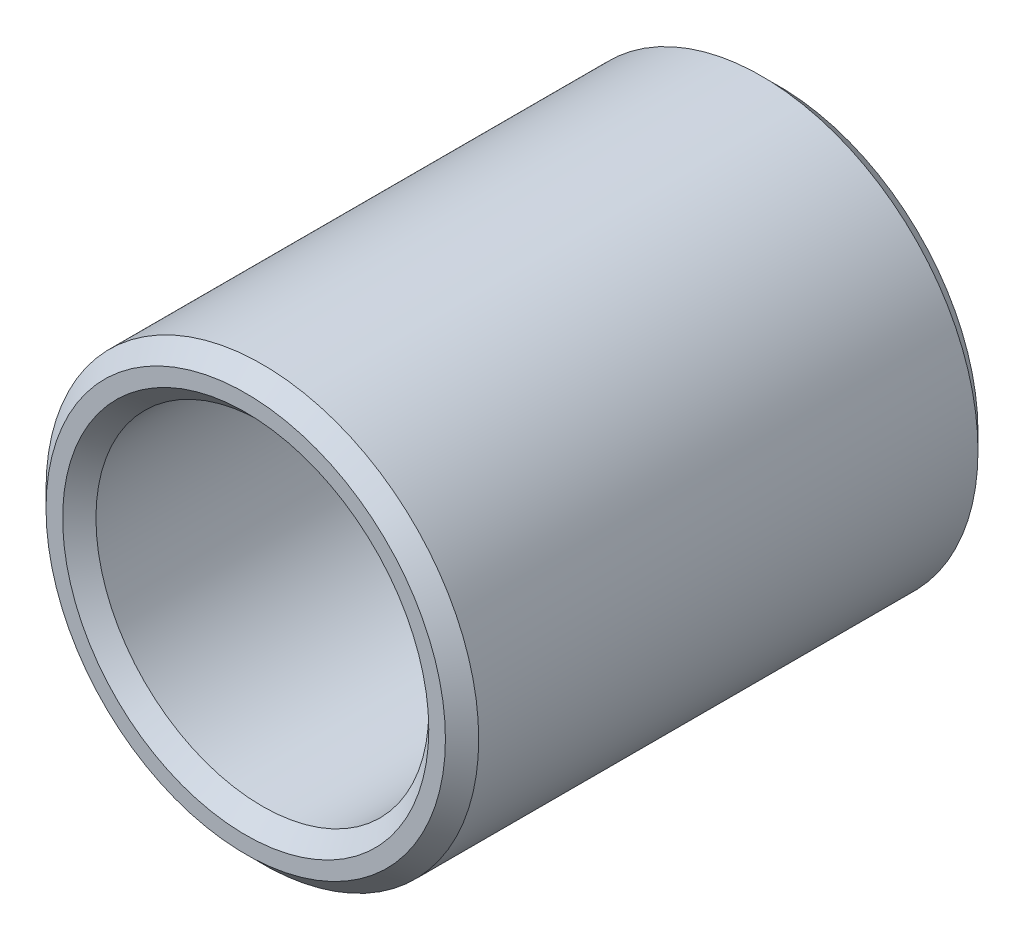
ISO-10303-21;
HEADER;
FILE_DESCRIPTION(('STEP AP214'),'2;1');
FILE_NAME('part.step','',(''),(''),'','','');
FILE_SCHEMA(('AUTOMOTIVE_DESIGN { 1 0 10303 214 1 1 1 1 }'));
ENDSEC;
DATA;
#1=APPLICATION_CONTEXT('core data for automotive mechanical design processes');
#2=APPLICATION_PROTOCOL_DEFINITION('international standard','automotive_design',2000,#1);
#3=PRODUCT_CONTEXT('',#1,'mechanical');
#4=PRODUCT('Part','Part','',(#3));
#5=PRODUCT_RELATED_PRODUCT_CATEGORY('part','',(#4));
#6=PRODUCT_DEFINITION_FORMATION('','',#4);
#7=PRODUCT_DEFINITION_CONTEXT('part definition',#1,'design');
#8=PRODUCT_DEFINITION('design','',#6,#7);
#9=PRODUCT_DEFINITION_SHAPE('','',#8);
#10=(LENGTH_UNIT() NAMED_UNIT(*) SI_UNIT(.MILLI.,.METRE.));
#11=(NAMED_UNIT(*) PLANE_ANGLE_UNIT() SI_UNIT($,.RADIAN.));
#12=(NAMED_UNIT(*) SI_UNIT($,.STERADIAN.) SOLID_ANGLE_UNIT());
#13=UNCERTAINTY_MEASURE_WITH_UNIT(LENGTH_MEASURE(1.E-05),#10,'distance_accuracy_value','');
#14=(GEOMETRIC_REPRESENTATION_CONTEXT(3) GLOBAL_UNCERTAINTY_ASSIGNED_CONTEXT((#13)) GLOBAL_UNIT_ASSIGNED_CONTEXT((#10,
#11,#12)) REPRESENTATION_CONTEXT('',''));
#15=CARTESIAN_POINT('',(0.,0.,0.));
#16=DIRECTION('',(0.,0.,1.));
#17=DIRECTION('',(1.,0.,0.));
#18=AXIS2_PLACEMENT_3D('',#15,#16,#17);
#19=CARTESIAN_POINT('',(0.,0.,32.));
#20=DIRECTION('',(0.,0.,1.));
#21=DIRECTION('',(1.,0.,0.));
#22=AXIS2_PLACEMENT_3D('',#19,#20,#21);
#23=PLANE('',#22);
#24=CARTESIAN_POINT('',(0.,0.,32.));
#25=DIRECTION('',(0.,0.,1.));
#26=DIRECTION('',(1.,0.,0.));
#27=AXIS2_PLACEMENT_3D('',#24,#25,#26);
#28=CIRCLE('',#27,11.);
#29=CARTESIAN_POINT('',(11.,0.,32.));
#30=VERTEX_POINT('',#29);
#31=EDGE_CURVE('E10',#30,#30,#28,.F.);
#32=ORIENTED_EDGE('',*,*,#31,.T.);
#33=EDGE_LOOP('',(#32));
#34=FACE_BOUND('',#33,.T.);
#35=CARTESIAN_POINT('',(0.,0.,32.));
#36=DIRECTION('',(0.,0.,1.));
#37=DIRECTION('',(1.,0.,0.));
#38=AXIS2_PLACEMENT_3D('',#35,#36,#37);
#39=CIRCLE('',#38,12.);
#40=CARTESIAN_POINT('',(12.,0.,32.));
#41=VERTEX_POINT('',#40);
#42=EDGE_CURVE('E44',#41,#41,#39,.T.);
#43=ORIENTED_EDGE('',*,*,#42,.T.);
#44=EDGE_LOOP('',(#43));
#45=FACE_BOUND('',#44,.T.);
#46=ADVANCED_FACE('F37',(#34,#45),#23,.T.);
#47=CARTESIAN_POINT('',(0.,0.,0.));
#48=DIRECTION('',(0.,0.,1.));
#49=DIRECTION('',(1.,0.,0.));
#50=AXIS2_PLACEMENT_3D('',#47,#48,#49);
#51=PLANE('',#50);
#52=CARTESIAN_POINT('',(0.,0.,0.));
#53=DIRECTION('',(0.,0.,1.));
#54=DIRECTION('',(1.,0.,0.));
#55=AXIS2_PLACEMENT_3D('',#52,#53,#54);
#56=CIRCLE('',#55,11.);
#57=CARTESIAN_POINT('',(11.,0.,0.));
#58=VERTEX_POINT('',#57);
#59=EDGE_CURVE('E63',#58,#58,#56,.T.);
#60=ORIENTED_EDGE('',*,*,#59,.T.);
#61=EDGE_LOOP('',(#60));
#62=FACE_BOUND('',#61,.T.);
#63=CARTESIAN_POINT('',(0.,0.,0.));
#64=DIRECTION('',(0.,0.,1.));
#65=DIRECTION('',(1.,0.,0.));
#66=AXIS2_PLACEMENT_3D('',#63,#64,#65);
#67=CIRCLE('',#66,12.);
#68=CARTESIAN_POINT('',(12.,0.,0.));
#69=VERTEX_POINT('',#68);
#70=EDGE_CURVE('E66',#69,#69,#67,.F.);
#71=ORIENTED_EDGE('',*,*,#70,.T.);
#72=EDGE_LOOP('',(#71));
#73=FACE_BOUND('',#72,.T.);
#74=ADVANCED_FACE('F70',(#62,#73),#51,.F.);
#75=CARTESIAN_POINT('',(0.,0.,32.));
#76=DIRECTION('',(0.,0.,-1.));
#77=DIRECTION('',(-1.,0.,0.));
#78=AXIS2_PLACEMENT_3D('',#75,#76,#77);
#79=CYLINDRICAL_SURFACE('',#78,13.);
#80=CARTESIAN_POINT('',(0.,0.,1.));
#81=DIRECTION('',(0.,0.,1.));
#82=DIRECTION('',(1.,0.,0.));
#83=AXIS2_PLACEMENT_3D('',#80,#81,#82);
#84=CIRCLE('',#83,13.);
#85=CARTESIAN_POINT('',(13.,0.,1.));
#86=VERTEX_POINT('',#85);
#87=EDGE_CURVE('E48',#86,#86,#84,.T.);
#88=ORIENTED_EDGE('',*,*,#87,.T.);
#89=EDGE_LOOP('',(#88));
#90=FACE_BOUND('',#89,.T.);
#91=CARTESIAN_POINT('',(0.,0.,31.));
#92=DIRECTION('',(0.,0.,1.));
#93=DIRECTION('',(1.,0.,0.));
#94=AXIS2_PLACEMENT_3D('',#91,#92,#93);
#95=CIRCLE('',#94,13.);
#96=CARTESIAN_POINT('',(13.,0.,31.));
#97=VERTEX_POINT('',#96);
#98=EDGE_CURVE('E52',#97,#97,#95,.F.);
#99=ORIENTED_EDGE('',*,*,#98,.T.);
#100=EDGE_LOOP('',(#99));
#101=FACE_BOUND('',#100,.T.);
#102=ADVANCED_FACE('F39',(#90,#101),#79,.T.);
#103=CARTESIAN_POINT('',(0.,0.,32.));
#104=DIRECTION('',(0.,0.,-1.));
#105=DIRECTION('',(-1.,0.,0.));
#106=AXIS2_PLACEMENT_3D('',#103,#104,#105);
#107=CYLINDRICAL_SURFACE('',#106,10.);
#108=CARTESIAN_POINT('',(0.,0.,1.));
#109=DIRECTION('',(0.,0.,1.));
#110=DIRECTION('',(1.,0.,0.));
#111=AXIS2_PLACEMENT_3D('',#108,#109,#110);
#112=CIRCLE('',#111,10.);
#113=CARTESIAN_POINT('',(10.,0.,1.));
#114=VERTEX_POINT('',#113);
#115=EDGE_CURVE('E57',#114,#114,#112,.F.);
#116=ORIENTED_EDGE('',*,*,#115,.T.);
#117=EDGE_LOOP('',(#116));
#118=FACE_BOUND('',#117,.T.);
#119=CARTESIAN_POINT('',(0.,0.,31.));
#120=DIRECTION('',(0.,0.,1.));
#121=DIRECTION('',(1.,0.,0.));
#122=AXIS2_PLACEMENT_3D('',#119,#120,#121);
#123=CIRCLE('',#122,10.);
#124=CARTESIAN_POINT('',(10.,0.,31.));
#125=VERTEX_POINT('',#124);
#126=EDGE_CURVE('E60',#125,#125,#123,.T.);
#127=ORIENTED_EDGE('',*,*,#126,.T.);
#128=EDGE_LOOP('',(#127));
#129=FACE_BOUND('',#128,.T.);
#130=ADVANCED_FACE('F82',(#118,#129),#107,.F.);
#131=CARTESIAN_POINT('',(0.,0.,0.));
#132=DIRECTION('',(0.,0.,-1.));
#133=DIRECTION('',(-1.,0.,0.));
#134=AXIS2_PLACEMENT_3D('',#131,#132,#133);
#135=CONICAL_SURFACE('',#134,11.,0.785398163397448);
#136=ORIENTED_EDGE('',*,*,#115,.F.);
#137=EDGE_LOOP('',(#136));
#138=FACE_BOUND('',#137,.T.);
#139=ORIENTED_EDGE('',*,*,#59,.F.);
#140=EDGE_LOOP('',(#139));
#141=FACE_BOUND('',#140,.T.);
#142=ADVANCED_FACE('F76',(#138,#141),#135,.F.);
#143=CARTESIAN_POINT('',(0.,0.,1.));
#144=DIRECTION('',(0.,0.,1.));
#145=DIRECTION('',(1.,0.,0.));
#146=AXIS2_PLACEMENT_3D('',#143,#144,#145);
#147=CONICAL_SURFACE('',#146,13.,0.78539816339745);
#148=ORIENTED_EDGE('',*,*,#70,.F.);
#149=EDGE_LOOP('',(#148));
#150=FACE_BOUND('',#149,.T.);
#151=ORIENTED_EDGE('',*,*,#87,.F.);
#152=EDGE_LOOP('',(#151));
#153=FACE_BOUND('',#152,.T.);
#154=ADVANCED_FACE('F72',(#150,#153),#147,.T.);
#155=CARTESIAN_POINT('',(0.,0.,31.));
#156=DIRECTION('',(0.,0.,1.));
#157=DIRECTION('',(1.,0.,0.));
#158=AXIS2_PLACEMENT_3D('',#155,#156,#157);
#159=CONICAL_SURFACE('',#158,10.,0.785398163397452);
#160=ORIENTED_EDGE('',*,*,#31,.F.);
#161=EDGE_LOOP('',(#160));
#162=FACE_BOUND('',#161,.T.);
#163=ORIENTED_EDGE('',*,*,#126,.F.);
#164=EDGE_LOOP('',(#163));
#165=FACE_BOUND('',#164,.T.);
#166=ADVANCED_FACE('F75',(#162,#165),#159,.F.);
#167=CARTESIAN_POINT('',(0.,0.,32.));
#168=DIRECTION('',(0.,0.,-1.));
#169=DIRECTION('',(-1.,0.,0.));
#170=AXIS2_PLACEMENT_3D('',#167,#168,#169);
#171=CONICAL_SURFACE('',#170,12.,0.785398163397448);
#172=ORIENTED_EDGE('',*,*,#98,.F.);
#173=EDGE_LOOP('',(#172));
#174=FACE_BOUND('',#173,.T.);
#175=ORIENTED_EDGE('',*,*,#42,.F.);
#176=EDGE_LOOP('',(#175));
#177=FACE_BOUND('',#176,.T.);
#178=ADVANCED_FACE('F85',(#174,#177),#171,.T.);
#179=CLOSED_SHELL('',(#46,#74,#102,#130,#142,#154,#166,#178));
#180=MANIFOLD_SOLID_BREP('B2',#179);
#181=ADVANCED_BREP_SHAPE_REPRESENTATION('',(#18,#180),#14);
#182=SHAPE_DEFINITION_REPRESENTATION(#9,#181);
ENDSEC;
END-ISO-10303-21;
